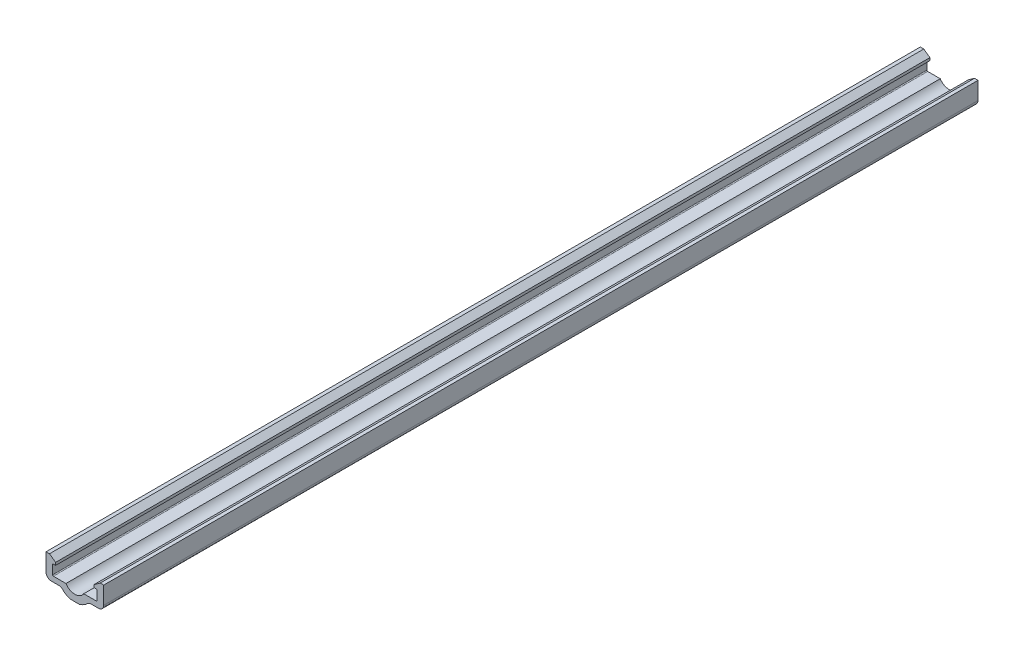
ISO-10303-21;
HEADER;
FILE_DESCRIPTION(('STEP AP214'),'2;1');
FILE_NAME('part.step','',(''),(''),'','','');
FILE_SCHEMA(('AUTOMOTIVE_DESIGN { 1 0 10303 214 1 1 1 1 }'));
ENDSEC;
DATA;
#1=APPLICATION_CONTEXT('core data for automotive mechanical design processes');
#2=APPLICATION_PROTOCOL_DEFINITION('international standard','automotive_design',2000,#1);
#3=PRODUCT_CONTEXT('',#1,'mechanical');
#4=PRODUCT('Part','Part','',(#3));
#5=PRODUCT_RELATED_PRODUCT_CATEGORY('part','',(#4));
#6=PRODUCT_DEFINITION_FORMATION('','',#4);
#7=PRODUCT_DEFINITION_CONTEXT('part definition',#1,'design');
#8=PRODUCT_DEFINITION('design','',#6,#7);
#9=PRODUCT_DEFINITION_SHAPE('','',#8);
#10=(LENGTH_UNIT() NAMED_UNIT(*) SI_UNIT(.MILLI.,.METRE.));
#11=(NAMED_UNIT(*) PLANE_ANGLE_UNIT() SI_UNIT($,.RADIAN.));
#12=(NAMED_UNIT(*) SI_UNIT($,.STERADIAN.) SOLID_ANGLE_UNIT());
#13=UNCERTAINTY_MEASURE_WITH_UNIT(LENGTH_MEASURE(1.E-05),#10,'distance_accuracy_value','');
#14=(GEOMETRIC_REPRESENTATION_CONTEXT(3) GLOBAL_UNCERTAINTY_ASSIGNED_CONTEXT((#13)) GLOBAL_UNIT_ASSIGNED_CONTEXT((#10,
#11,#12)) REPRESENTATION_CONTEXT('',''));
#15=CARTESIAN_POINT('',(0.,0.,0.));
#16=DIRECTION('',(0.,0.,1.));
#17=DIRECTION('',(1.,0.,0.));
#18=AXIS2_PLACEMENT_3D('',#15,#16,#17);
#19=CARTESIAN_POINT('',(0.,9.68245836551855,500.));
#20=DIRECTION('',(0.,0.,-1.));
#21=DIRECTION('',(-1.,0.,0.));
#22=AXIS2_PLACEMENT_3D('',#19,#20,#21);
#23=CYLINDRICAL_SURFACE('',#22,6.);
#24=CARTESIAN_POINT('',(0.,9.68245836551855,0.));
#25=DIRECTION('',(0.,0.,-1.));
#26=DIRECTION('',(1.,0.,0.));
#27=AXIS2_PLACEMENT_3D('',#24,#25,#26);
#28=CIRCLE('',#27,6.);
#29=CARTESIAN_POINT('',(5.08644854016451,6.5,0.));
#30=VERTEX_POINT('',#29);
#31=CARTESIAN_POINT('',(-5.08644854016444,6.5,0.));
#32=VERTEX_POINT('',#31);
#33=EDGE_CURVE('E202',#30,#32,#28,.T.);
#34=ORIENTED_EDGE('',*,*,#33,.T.);
#35=DIRECTION('',(0.,0.,-1.));
#36=VECTOR('',#35,1.);
#37=CARTESIAN_POINT('',(-5.08644854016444,6.5,500.));
#38=LINE('',#37,#36);
#39=CARTESIAN_POINT('',(-5.08644854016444,6.5,500.));
#40=VERTEX_POINT('',#39);
#41=EDGE_CURVE('E9',#40,#32,#38,.T.);
#42=ORIENTED_EDGE('',*,*,#41,.F.);
#43=CARTESIAN_POINT('',(0.,9.68245836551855,500.));
#44=DIRECTION('',(0.,0.,-1.));
#45=DIRECTION('',(1.,0.,0.));
#46=AXIS2_PLACEMENT_3D('',#43,#44,#45);
#47=CIRCLE('',#46,6.);
#48=CARTESIAN_POINT('',(5.08644854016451,6.5,500.));
#49=VERTEX_POINT('',#48);
#50=EDGE_CURVE('E269',#49,#40,#47,.T.);
#51=ORIENTED_EDGE('',*,*,#50,.F.);
#52=DIRECTION('',(0.,0.,-1.));
#53=VECTOR('',#52,1.);
#54=CARTESIAN_POINT('',(5.08644854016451,6.5,500.));
#55=LINE('',#54,#53);
#56=EDGE_CURVE('E215',#49,#30,#55,.T.);
#57=ORIENTED_EDGE('',*,*,#56,.T.);
#58=EDGE_LOOP('',(#34,#42,#51,#57));
#59=FACE_BOUND('',#58,.T.);
#60=ADVANCED_FACE('F14',(#59),#23,.F.);
#61=CARTESIAN_POINT('',(-5.08644854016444,6.5,500.));
#62=DIRECTION('',(0.,-1.,0.));
#63=DIRECTION('',(0.,0.,-1.));
#64=AXIS2_PLACEMENT_3D('',#61,#62,#63);
#65=PLANE('',#64);
#66=DIRECTION('',(-1.,0.,0.));
#67=VECTOR('',#66,1.);
#68=CARTESIAN_POINT('',(-5.08644854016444,6.5,0.));
#69=LINE('',#68,#67);
#70=CARTESIAN_POINT('',(-12.25,6.5,0.));
#71=VERTEX_POINT('',#70);
#72=EDGE_CURVE('E198',#32,#71,#69,.T.);
#73=ORIENTED_EDGE('',*,*,#72,.T.);
#74=DIRECTION('',(0.,0.,-1.));
#75=VECTOR('',#74,1.);
#76=CARTESIAN_POINT('',(-12.25,6.5,500.));
#77=LINE('',#76,#75);
#78=CARTESIAN_POINT('',(-12.25,6.5,500.));
#79=VERTEX_POINT('',#78);
#80=EDGE_CURVE('E21',#79,#71,#77,.T.);
#81=ORIENTED_EDGE('',*,*,#80,.F.);
#82=DIRECTION('',(-1.,0.,0.));
#83=VECTOR('',#82,1.);
#84=CARTESIAN_POINT('',(-5.08644854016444,6.5,500.));
#85=LINE('',#84,#83);
#86=EDGE_CURVE('E211',#40,#79,#85,.T.);
#87=ORIENTED_EDGE('',*,*,#86,.F.);
#88=ORIENTED_EDGE('',*,*,#41,.T.);
#89=EDGE_LOOP('',(#73,#81,#87,#88));
#90=FACE_BOUND('',#89,.T.);
#91=ADVANCED_FACE('F210',(#90),#65,.F.);
#92=CARTESIAN_POINT('',(-12.25,7.,500.));
#93=DIRECTION('',(0.,0.,-1.));
#94=DIRECTION('',(-1.,0.,0.));
#95=AXIS2_PLACEMENT_3D('',#92,#93,#94);
#96=CYLINDRICAL_SURFACE('',#95,0.5);
#97=CARTESIAN_POINT('',(-12.25,7.,0.));
#98=DIRECTION('',(0.,0.,-1.));
#99=DIRECTION('',(1.,0.,0.));
#100=AXIS2_PLACEMENT_3D('',#97,#98,#99);
#101=CIRCLE('',#100,0.5);
#102=CARTESIAN_POINT('',(-12.75,7.,0.));
#103=VERTEX_POINT('',#102);
#104=EDGE_CURVE('E204',#71,#103,#101,.T.);
#105=ORIENTED_EDGE('',*,*,#104,.T.);
#106=DIRECTION('',(0.,0.,-1.));
#107=VECTOR('',#106,1.);
#108=CARTESIAN_POINT('',(-12.75,7.,500.));
#109=LINE('',#108,#107);
#110=CARTESIAN_POINT('',(-12.75,7.,500.));
#111=VERTEX_POINT('',#110);
#112=EDGE_CURVE('E395',#111,#103,#109,.T.);
#113=ORIENTED_EDGE('',*,*,#112,.F.);
#114=CARTESIAN_POINT('',(-12.25,7.,500.));
#115=DIRECTION('',(0.,0.,-1.));
#116=DIRECTION('',(1.,0.,0.));
#117=AXIS2_PLACEMENT_3D('',#114,#115,#116);
#118=CIRCLE('',#117,0.5);
#119=EDGE_CURVE('E272',#79,#111,#118,.T.);
#120=ORIENTED_EDGE('',*,*,#119,.F.);
#121=ORIENTED_EDGE('',*,*,#80,.T.);
#122=EDGE_LOOP('',(#105,#113,#120,#121));
#123=FACE_BOUND('',#122,.T.);
#124=ADVANCED_FACE('F399',(#123),#96,.F.);
#125=CARTESIAN_POINT('',(-12.75,12.,500.));
#126=DIRECTION('',(-1.,0.,0.));
#127=DIRECTION('',(0.,0.,1.));
#128=AXIS2_PLACEMENT_3D('',#125,#126,#127);
#129=PLANE('',#128);
#130=DIRECTION('',(0.,1.,0.));
#131=VECTOR('',#130,1.);
#132=CARTESIAN_POINT('',(-12.75,12.,0.));
#133=LINE('',#132,#131);
#134=CARTESIAN_POINT('',(-12.75,12.,0.));
#135=VERTEX_POINT('',#134);
#136=EDGE_CURVE('E219',#103,#135,#133,.T.);
#137=ORIENTED_EDGE('',*,*,#136,.T.);
#138=DIRECTION('',(0.,0.,-1.));
#139=VECTOR('',#138,1.);
#140=CARTESIAN_POINT('',(-12.75,12.,500.));
#141=LINE('',#140,#139);
#142=CARTESIAN_POINT('',(-12.75,12.,500.));
#143=VERTEX_POINT('',#142);
#144=EDGE_CURVE('E392',#143,#135,#141,.T.);
#145=ORIENTED_EDGE('',*,*,#144,.F.);
#146=DIRECTION('',(0.,1.,0.));
#147=VECTOR('',#146,1.);
#148=CARTESIAN_POINT('',(-12.75,12.,500.));
#149=LINE('',#148,#147);
#150=EDGE_CURVE('E274',#111,#143,#149,.T.);
#151=ORIENTED_EDGE('',*,*,#150,.F.);
#152=ORIENTED_EDGE('',*,*,#112,.T.);
#153=EDGE_LOOP('',(#137,#145,#151,#152));
#154=FACE_BOUND('',#153,.T.);
#155=ADVANCED_FACE('F407',(#154),#129,.F.);
#156=CARTESIAN_POINT('',(-12.25,12.,500.));
#157=DIRECTION('',(0.,0.,-1.));
#158=DIRECTION('',(-1.,0.,0.));
#159=AXIS2_PLACEMENT_3D('',#156,#157,#158);
#160=CYLINDRICAL_SURFACE('',#159,0.5);
#161=CARTESIAN_POINT('',(-12.25,12.,0.));
#162=DIRECTION('',(0.,0.,-1.));
#163=DIRECTION('',(1.,0.,0.));
#164=AXIS2_PLACEMENT_3D('',#161,#162,#163);
#165=CIRCLE('',#164,0.5);
#166=CARTESIAN_POINT('',(-12.25,12.5,0.));
#167=VERTEX_POINT('',#166);
#168=EDGE_CURVE('E221',#135,#167,#165,.T.);
#169=ORIENTED_EDGE('',*,*,#168,.T.);
#170=DIRECTION('',(0.,0.,-1.));
#171=VECTOR('',#170,1.);
#172=CARTESIAN_POINT('',(-12.25,12.5,500.));
#173=LINE('',#172,#171);
#174=CARTESIAN_POINT('',(-12.25,12.5,500.));
#175=VERTEX_POINT('',#174);
#176=EDGE_CURVE('E389',#175,#167,#173,.T.);
#177=ORIENTED_EDGE('',*,*,#176,.F.);
#178=CARTESIAN_POINT('',(-12.25,12.,500.));
#179=DIRECTION('',(0.,0.,-1.));
#180=DIRECTION('',(1.,0.,0.));
#181=AXIS2_PLACEMENT_3D('',#178,#179,#180);
#182=CIRCLE('',#181,0.5);
#183=EDGE_CURVE('E276',#143,#175,#182,.T.);
#184=ORIENTED_EDGE('',*,*,#183,.F.);
#185=ORIENTED_EDGE('',*,*,#144,.T.);
#186=EDGE_LOOP('',(#169,#177,#184,#185));
#187=FACE_BOUND('',#186,.T.);
#188=ADVANCED_FACE('F410',(#187),#160,.F.);
#189=CARTESIAN_POINT('',(-11.,12.5,500.));
#190=DIRECTION('',(0.,1.,0.));
#191=DIRECTION('',(-1.,0.,0.));
#192=AXIS2_PLACEMENT_3D('',#189,#190,#191);
#193=PLANE('',#192);
#194=DIRECTION('',(1.,0.,0.));
#195=VECTOR('',#194,1.);
#196=CARTESIAN_POINT('',(-11.,12.5,0.));
#197=LINE('',#196,#195);
#198=CARTESIAN_POINT('',(-11.,12.5,0.));
#199=VERTEX_POINT('',#198);
#200=EDGE_CURVE('E223',#167,#199,#197,.T.);
#201=ORIENTED_EDGE('',*,*,#200,.T.);
#202=DIRECTION('',(0.,0.,-1.));
#203=VECTOR('',#202,1.);
#204=CARTESIAN_POINT('',(-11.,12.5,500.));
#205=LINE('',#204,#203);
#206=CARTESIAN_POINT('',(-11.,12.5,500.));
#207=VERTEX_POINT('',#206);
#208=EDGE_CURVE('E386',#207,#199,#205,.T.);
#209=ORIENTED_EDGE('',*,*,#208,.F.);
#210=DIRECTION('',(1.,0.,0.));
#211=VECTOR('',#210,1.);
#212=CARTESIAN_POINT('',(-11.,12.5,500.));
#213=LINE('',#212,#211);
#214=EDGE_CURVE('E278',#175,#207,#213,.T.);
#215=ORIENTED_EDGE('',*,*,#214,.F.);
#216=ORIENTED_EDGE('',*,*,#176,.T.);
#217=EDGE_LOOP('',(#201,#209,#215,#216));
#218=FACE_BOUND('',#217,.T.);
#219=ADVANCED_FACE('F415',(#218),#193,.F.);
#220=CARTESIAN_POINT('',(-11.,14.,500.));
#221=DIRECTION('',(-1.,0.,0.));
#222=DIRECTION('',(0.,-1.,0.));
#223=AXIS2_PLACEMENT_3D('',#220,#221,#222);
#224=PLANE('',#223);
#225=DIRECTION('',(0.,1.,0.));
#226=VECTOR('',#225,1.);
#227=CARTESIAN_POINT('',(-11.,14.,0.));
#228=LINE('',#227,#226);
#229=CARTESIAN_POINT('',(-11.,14.,0.));
#230=VERTEX_POINT('',#229);
#231=EDGE_CURVE('E225',#199,#230,#228,.T.);
#232=ORIENTED_EDGE('',*,*,#231,.T.);
#233=DIRECTION('',(0.,0.,-1.));
#234=VECTOR('',#233,1.);
#235=CARTESIAN_POINT('',(-11.,14.,500.));
#236=LINE('',#235,#234);
#237=CARTESIAN_POINT('',(-11.,14.,500.));
#238=VERTEX_POINT('',#237);
#239=EDGE_CURVE('E383',#238,#230,#236,.T.);
#240=ORIENTED_EDGE('',*,*,#239,.F.);
#241=DIRECTION('',(0.,1.,0.));
#242=VECTOR('',#241,1.);
#243=CARTESIAN_POINT('',(-11.,14.,500.));
#244=LINE('',#243,#242);
#245=EDGE_CURVE('E280',#207,#238,#244,.T.);
#246=ORIENTED_EDGE('',*,*,#245,.F.);
#247=ORIENTED_EDGE('',*,*,#208,.T.);
#248=EDGE_LOOP('',(#232,#240,#246,#247));
#249=FACE_BOUND('',#248,.T.);
#250=ADVANCED_FACE('F421',(#249),#224,.F.);
#251=CARTESIAN_POINT('',(-14.5,16.5,500.));
#252=DIRECTION('',(-0.581238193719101,-0.813733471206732,0.));
#253=DIRECTION('',(0.813733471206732,-0.581238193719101,0.));
#254=AXIS2_PLACEMENT_3D('',#251,#252,#253);
#255=PLANE('',#254);
#256=DIRECTION('',(-0.813733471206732,0.581238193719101,0.));
#257=VECTOR('',#256,1.);
#258=CARTESIAN_POINT('',(-14.5,16.5,0.));
#259=LINE('',#258,#257);
#260=CARTESIAN_POINT('',(-14.5,16.5,0.));
#261=VERTEX_POINT('',#260);
#262=EDGE_CURVE('E227',#230,#261,#259,.T.);
#263=ORIENTED_EDGE('',*,*,#262,.T.);
#264=DIRECTION('',(0.,0.,-1.));
#265=VECTOR('',#264,1.);
#266=CARTESIAN_POINT('',(-14.5,16.5,500.));
#267=LINE('',#266,#265);
#268=CARTESIAN_POINT('',(-14.5,16.5,500.));
#269=VERTEX_POINT('',#268);
#270=EDGE_CURVE('E380',#269,#261,#267,.T.);
#271=ORIENTED_EDGE('',*,*,#270,.F.);
#272=DIRECTION('',(-0.813733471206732,0.581238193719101,0.));
#273=VECTOR('',#272,1.);
#274=CARTESIAN_POINT('',(-14.5,16.5,500.));
#275=LINE('',#274,#273);
#276=EDGE_CURVE('E282',#238,#269,#275,.T.);
#277=ORIENTED_EDGE('',*,*,#276,.F.);
#278=ORIENTED_EDGE('',*,*,#239,.T.);
#279=EDGE_LOOP('',(#263,#271,#277,#278));
#280=FACE_BOUND('',#279,.T.);
#281=ADVANCED_FACE('F425',(#280),#255,.F.);
#282=CARTESIAN_POINT('',(-14.5,16.5,500.));
#283=DIRECTION('',(0.,-1.,0.));
#284=DIRECTION('',(0.,0.,-1.));
#285=AXIS2_PLACEMENT_3D('',#282,#283,#284);
#286=PLANE('',#285);
#287=DIRECTION('',(-1.,0.,0.));
#288=VECTOR('',#287,1.);
#289=CARTESIAN_POINT('',(-14.5,16.5,0.));
#290=LINE('',#289,#288);
#291=CARTESIAN_POINT('',(-16.5,16.5,0.));
#292=VERTEX_POINT('',#291);
#293=EDGE_CURVE('E229',#261,#292,#290,.T.);
#294=ORIENTED_EDGE('',*,*,#293,.T.);
#295=DIRECTION('',(0.,0.,-1.));
#296=VECTOR('',#295,1.);
#297=CARTESIAN_POINT('',(-16.5,16.5,500.));
#298=LINE('',#297,#296);
#299=CARTESIAN_POINT('',(-16.5,16.5,500.));
#300=VERTEX_POINT('',#299);
#301=EDGE_CURVE('E377',#300,#292,#298,.T.);
#302=ORIENTED_EDGE('',*,*,#301,.F.);
#303=DIRECTION('',(-1.,0.,0.));
#304=VECTOR('',#303,1.);
#305=CARTESIAN_POINT('',(-14.5,16.5,500.));
#306=LINE('',#305,#304);
#307=EDGE_CURVE('E284',#269,#300,#306,.T.);
#308=ORIENTED_EDGE('',*,*,#307,.F.);
#309=ORIENTED_EDGE('',*,*,#270,.T.);
#310=EDGE_LOOP('',(#294,#302,#308,#309));
#311=FACE_BOUND('',#310,.T.);
#312=ADVANCED_FACE('F430',(#311),#286,.F.);
#313=CARTESIAN_POINT('',(-16.5,16.5,500.));
#314=DIRECTION('',(1.,0.,0.));
#315=DIRECTION('',(0.,1.,0.));
#316=AXIS2_PLACEMENT_3D('',#313,#314,#315);
#317=PLANE('',#316);
#318=DIRECTION('',(0.,-1.,0.));
#319=VECTOR('',#318,1.);
#320=CARTESIAN_POINT('',(-16.5,16.5,0.));
#321=LINE('',#320,#319);
#322=CARTESIAN_POINT('',(-16.5,6.5,0.));
#323=VERTEX_POINT('',#322);
#324=EDGE_CURVE('E231',#292,#323,#321,.T.);
#325=ORIENTED_EDGE('',*,*,#324,.T.);
#326=DIRECTION('',(0.,0.,-1.));
#327=VECTOR('',#326,1.);
#328=CARTESIAN_POINT('',(-16.5,6.5,500.));
#329=LINE('',#328,#327);
#330=CARTESIAN_POINT('',(-16.5,6.5,500.));
#331=VERTEX_POINT('',#330);
#332=EDGE_CURVE('E374',#331,#323,#329,.T.);
#333=ORIENTED_EDGE('',*,*,#332,.F.);
#334=DIRECTION('',(0.,-1.,0.));
#335=VECTOR('',#334,1.);
#336=CARTESIAN_POINT('',(-16.5,16.5,500.));
#337=LINE('',#336,#335);
#338=EDGE_CURVE('E286',#300,#331,#337,.T.);
#339=ORIENTED_EDGE('',*,*,#338,.F.);
#340=ORIENTED_EDGE('',*,*,#301,.T.);
#341=EDGE_LOOP('',(#325,#333,#339,#340));
#342=FACE_BOUND('',#341,.T.);
#343=ADVANCED_FACE('F436',(#342),#317,.F.);
#344=CARTESIAN_POINT('',(-13.5,6.5,500.));
#345=DIRECTION('',(0.,0.,-1.));
#346=DIRECTION('',(-1.,0.,0.));
#347=AXIS2_PLACEMENT_3D('',#344,#345,#346);
#348=CYLINDRICAL_SURFACE('',#347,3.);
#349=CARTESIAN_POINT('',(-13.5,6.5,0.));
#350=DIRECTION('',(0.,0.,1.));
#351=DIRECTION('',(1.,0.,0.));
#352=AXIS2_PLACEMENT_3D('',#349,#350,#351);
#353=CIRCLE('',#352,3.);
#354=CARTESIAN_POINT('',(-13.5,3.50000000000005,0.));
#355=VERTEX_POINT('',#354);
#356=EDGE_CURVE('E233',#323,#355,#353,.T.);
#357=ORIENTED_EDGE('',*,*,#356,.T.);
#358=DIRECTION('',(0.,0.,-1.));
#359=VECTOR('',#358,1.);
#360=CARTESIAN_POINT('',(-13.5,3.50000000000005,500.));
#361=LINE('',#360,#359);
#362=CARTESIAN_POINT('',(-13.5,3.50000000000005,500.));
#363=VERTEX_POINT('',#362);
#364=EDGE_CURVE('E371',#363,#355,#361,.T.);
#365=ORIENTED_EDGE('',*,*,#364,.F.);
#366=CARTESIAN_POINT('',(-13.5,6.5,500.));
#367=DIRECTION('',(0.,0.,1.));
#368=DIRECTION('',(1.,0.,0.));
#369=AXIS2_PLACEMENT_3D('',#366,#367,#368);
#370=CIRCLE('',#369,3.);
#371=EDGE_CURVE('E288',#331,#363,#370,.T.);
#372=ORIENTED_EDGE('',*,*,#371,.F.);
#373=ORIENTED_EDGE('',*,*,#332,.T.);
#374=EDGE_LOOP('',(#357,#365,#372,#373));
#375=FACE_BOUND('',#374,.T.);
#376=ADVANCED_FACE('F440',(#375),#348,.T.);
#377=CARTESIAN_POINT('',(-9.20230723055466,3.50000000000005,500.));
#378=DIRECTION('',(0.,1.,0.));
#379=DIRECTION('',(0.,0.,1.));
#380=AXIS2_PLACEMENT_3D('',#377,#378,#379);
#381=PLANE('',#380);
#382=DIRECTION('',(1.,0.,0.));
#383=VECTOR('',#382,1.);
#384=CARTESIAN_POINT('',(-9.20230723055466,3.50000000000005,0.));
#385=LINE('',#384,#383);
#386=CARTESIAN_POINT('',(-9.20230723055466,3.50000000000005,0.));
#387=VERTEX_POINT('',#386);
#388=EDGE_CURVE('E235',#355,#387,#385,.T.);
#389=ORIENTED_EDGE('',*,*,#388,.T.);
#390=DIRECTION('',(0.,0.,-1.));
#391=VECTOR('',#390,1.);
#392=CARTESIAN_POINT('',(-9.20230723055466,3.50000000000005,500.));
#393=LINE('',#392,#391);
#394=CARTESIAN_POINT('',(-9.20230723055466,3.50000000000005,500.));
#395=VERTEX_POINT('',#394);
#396=EDGE_CURVE('E368',#395,#387,#393,.T.);
#397=ORIENTED_EDGE('',*,*,#396,.F.);
#398=DIRECTION('',(1.,0.,0.));
#399=VECTOR('',#398,1.);
#400=CARTESIAN_POINT('',(-9.20230723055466,3.50000000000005,500.));
#401=LINE('',#400,#399);
#402=EDGE_CURVE('E290',#363,#395,#401,.T.);
#403=ORIENTED_EDGE('',*,*,#402,.F.);
#404=ORIENTED_EDGE('',*,*,#364,.T.);
#405=EDGE_LOOP('',(#389,#397,#403,#404));
#406=FACE_BOUND('',#405,.T.);
#407=ADVANCED_FACE('F445',(#406),#381,.F.);
#408=CARTESIAN_POINT('',(-9.20230723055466,0.500000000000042,500.));
#409=DIRECTION('',(0.,0.,-1.));
#410=DIRECTION('',(-1.,0.,0.));
#411=AXIS2_PLACEMENT_3D('',#408,#409,#410);
#412=CYLINDRICAL_SURFACE('',#411,3.);
#413=CARTESIAN_POINT('',(-9.20230723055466,0.500000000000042,0.));
#414=DIRECTION('',(0.,0.,-1.));
#415=DIRECTION('',(1.,0.,0.));
#416=AXIS2_PLACEMENT_3D('',#413,#414,#415);
#417=CIRCLE('',#416,3.);
#418=CARTESIAN_POINT('',(-7.07869786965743,2.61902885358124,0.));
#419=VERTEX_POINT('',#418);
#420=EDGE_CURVE('E237',#387,#419,#417,.T.);
#421=ORIENTED_EDGE('',*,*,#420,.T.);
#422=DIRECTION('',(0.,0.,-1.));
#423=VECTOR('',#422,1.);
#424=CARTESIAN_POINT('',(-7.07869786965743,2.61902885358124,500.));
#425=LINE('',#424,#423);
#426=CARTESIAN_POINT('',(-7.07869786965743,2.61902885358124,500.));
#427=VERTEX_POINT('',#426);
#428=EDGE_CURVE('E365',#427,#419,#425,.T.);
#429=ORIENTED_EDGE('',*,*,#428,.F.);
#430=CARTESIAN_POINT('',(-9.20230723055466,0.500000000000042,500.));
#431=DIRECTION('',(0.,0.,-1.));
#432=DIRECTION('',(1.,0.,0.));
#433=AXIS2_PLACEMENT_3D('',#430,#431,#432);
#434=CIRCLE('',#433,3.);
#435=EDGE_CURVE('E292',#395,#427,#434,.T.);
#436=ORIENTED_EDGE('',*,*,#435,.F.);
#437=ORIENTED_EDGE('',*,*,#396,.T.);
#438=EDGE_LOOP('',(#421,#429,#436,#437));
#439=FACE_BOUND('',#438,.T.);
#440=ADVANCED_FACE('F451',(#439),#412,.F.);
#441=CARTESIAN_POINT('',(0.,9.68245836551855,500.));
#442=DIRECTION('',(0.,0.,-1.));
#443=DIRECTION('',(-1.,0.,0.));
#444=AXIS2_PLACEMENT_3D('',#441,#442,#443);
#445=CYLINDRICAL_SURFACE('',#444,10.);
#446=CARTESIAN_POINT('',(0.,9.68245836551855,0.));
#447=DIRECTION('',(0.,0.,1.));
#448=DIRECTION('',(1.,0.,0.));
#449=AXIS2_PLACEMENT_3D('',#446,#447,#448);
#450=CIRCLE('',#449,10.);
#451=CARTESIAN_POINT('',(-2.5,0.,0.));
#452=VERTEX_POINT('',#451);
#453=EDGE_CURVE('E239',#419,#452,#450,.T.);
#454=ORIENTED_EDGE('',*,*,#453,.T.);
#455=DIRECTION('',(0.,0.,-1.));
#456=VECTOR('',#455,1.);
#457=CARTESIAN_POINT('',(-2.5,0.,500.));
#458=LINE('',#457,#456);
#459=CARTESIAN_POINT('',(-2.5,0.,500.));
#460=VERTEX_POINT('',#459);
#461=EDGE_CURVE('E362',#460,#452,#458,.T.);
#462=ORIENTED_EDGE('',*,*,#461,.F.);
#463=CARTESIAN_POINT('',(0.,9.68245836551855,500.));
#464=DIRECTION('',(0.,0.,1.));
#465=DIRECTION('',(1.,0.,0.));
#466=AXIS2_PLACEMENT_3D('',#463,#464,#465);
#467=CIRCLE('',#466,10.);
#468=EDGE_CURVE('E294',#427,#460,#467,.T.);
#469=ORIENTED_EDGE('',*,*,#468,.F.);
#470=ORIENTED_EDGE('',*,*,#428,.T.);
#471=EDGE_LOOP('',(#454,#462,#469,#470));
#472=FACE_BOUND('',#471,.T.);
#473=ADVANCED_FACE('F455',(#472),#445,.T.);
#474=CARTESIAN_POINT('',(2.5,0.,500.));
#475=DIRECTION('',(0.,1.,0.));
#476=DIRECTION('',(-1.,0.,0.));
#477=AXIS2_PLACEMENT_3D('',#474,#475,#476);
#478=PLANE('',#477);
#479=DIRECTION('',(1.,0.,0.));
#480=VECTOR('',#479,1.);
#481=CARTESIAN_POINT('',(2.5,0.,0.));
#482=LINE('',#481,#480);
#483=CARTESIAN_POINT('',(2.5,0.,0.));
#484=VERTEX_POINT('',#483);
#485=EDGE_CURVE('E241',#452,#484,#482,.T.);
#486=ORIENTED_EDGE('',*,*,#485,.T.);
#487=DIRECTION('',(0.,0.,-1.));
#488=VECTOR('',#487,1.);
#489=CARTESIAN_POINT('',(2.5,0.,500.));
#490=LINE('',#489,#488);
#491=CARTESIAN_POINT('',(2.5,0.,500.));
#492=VERTEX_POINT('',#491);
#493=EDGE_CURVE('E359',#492,#484,#490,.T.);
#494=ORIENTED_EDGE('',*,*,#493,.F.);
#495=DIRECTION('',(1.,0.,0.));
#496=VECTOR('',#495,1.);
#497=CARTESIAN_POINT('',(2.5,0.,500.));
#498=LINE('',#497,#496);
#499=EDGE_CURVE('E296',#460,#492,#498,.T.);
#500=ORIENTED_EDGE('',*,*,#499,.F.);
#501=ORIENTED_EDGE('',*,*,#461,.T.);
#502=EDGE_LOOP('',(#486,#494,#500,#501));
#503=FACE_BOUND('',#502,.T.);
#504=ADVANCED_FACE('F460',(#503),#478,.F.);
#505=CARTESIAN_POINT('',(0.,9.68245836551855,500.));
#506=DIRECTION('',(0.,0.,-1.));
#507=DIRECTION('',(-1.,0.,0.));
#508=AXIS2_PLACEMENT_3D('',#505,#506,#507);
#509=CYLINDRICAL_SURFACE('',#508,10.);
#510=CARTESIAN_POINT('',(0.,9.68245836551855,0.));
#511=DIRECTION('',(0.,0.,1.));
#512=DIRECTION('',(1.,0.,0.));
#513=AXIS2_PLACEMENT_3D('',#510,#511,#512);
#514=CIRCLE('',#513,10.);
#515=CARTESIAN_POINT('',(7.0786978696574,2.61902885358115,0.));
#516=VERTEX_POINT('',#515);
#517=EDGE_CURVE('E243',#484,#516,#514,.T.);
#518=ORIENTED_EDGE('',*,*,#517,.T.);
#519=DIRECTION('',(0.,0.,-1.));
#520=VECTOR('',#519,1.);
#521=CARTESIAN_POINT('',(7.0786978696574,2.61902885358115,500.));
#522=LINE('',#521,#520);
#523=CARTESIAN_POINT('',(7.0786978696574,2.61902885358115,500.));
#524=VERTEX_POINT('',#523);
#525=EDGE_CURVE('E356',#524,#516,#522,.T.);
#526=ORIENTED_EDGE('',*,*,#525,.F.);
#527=CARTESIAN_POINT('',(0.,9.68245836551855,500.));
#528=DIRECTION('',(0.,0.,1.));
#529=DIRECTION('',(1.,0.,0.));
#530=AXIS2_PLACEMENT_3D('',#527,#528,#529);
#531=CIRCLE('',#530,10.);
#532=EDGE_CURVE('E298',#492,#524,#531,.T.);
#533=ORIENTED_EDGE('',*,*,#532,.F.);
#534=ORIENTED_EDGE('',*,*,#493,.T.);
#535=EDGE_LOOP('',(#518,#526,#533,#534));
#536=FACE_BOUND('',#535,.T.);
#537=ADVANCED_FACE('F466',(#536),#509,.T.);
#538=CARTESIAN_POINT('',(9.20230723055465,0.499999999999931,500.));
#539=DIRECTION('',(0.,0.,-1.));
#540=DIRECTION('',(-1.,0.,0.));
#541=AXIS2_PLACEMENT_3D('',#538,#539,#540);
#542=CYLINDRICAL_SURFACE('',#541,3.);
#543=CARTESIAN_POINT('',(9.20230723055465,0.499999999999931,0.));
#544=DIRECTION('',(0.,0.,-1.));
#545=DIRECTION('',(1.,0.,0.));
#546=AXIS2_PLACEMENT_3D('',#543,#544,#545);
#547=CIRCLE('',#546,3.);
#548=CARTESIAN_POINT('',(9.20230723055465,3.49999999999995,0.));
#549=VERTEX_POINT('',#548);
#550=EDGE_CURVE('E245',#516,#549,#547,.T.);
#551=ORIENTED_EDGE('',*,*,#550,.T.);
#552=DIRECTION('',(0.,0.,-1.));
#553=VECTOR('',#552,1.);
#554=CARTESIAN_POINT('',(9.20230723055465,3.49999999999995,500.));
#555=LINE('',#554,#553);
#556=CARTESIAN_POINT('',(9.20230723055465,3.49999999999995,500.));
#557=VERTEX_POINT('',#556);
#558=EDGE_CURVE('E353',#557,#549,#555,.T.);
#559=ORIENTED_EDGE('',*,*,#558,.F.);
#560=CARTESIAN_POINT('',(9.20230723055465,0.499999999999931,500.));
#561=DIRECTION('',(0.,0.,-1.));
#562=DIRECTION('',(1.,0.,0.));
#563=AXIS2_PLACEMENT_3D('',#560,#561,#562);
#564=CIRCLE('',#563,3.);
#565=EDGE_CURVE('E300',#524,#557,#564,.T.);
#566=ORIENTED_EDGE('',*,*,#565,.F.);
#567=ORIENTED_EDGE('',*,*,#525,.T.);
#568=EDGE_LOOP('',(#551,#559,#566,#567));
#569=FACE_BOUND('',#568,.T.);
#570=ADVANCED_FACE('F470',(#569),#542,.F.);
#571=CARTESIAN_POINT('',(13.5,3.49999999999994,500.));
#572=DIRECTION('',(0.,1.,0.));
#573=DIRECTION('',(0.,0.,1.));
#574=AXIS2_PLACEMENT_3D('',#571,#572,#573);
#575=PLANE('',#574);
#576=DIRECTION('',(1.,0.,0.));
#577=VECTOR('',#576,1.);
#578=CARTESIAN_POINT('',(13.5,3.49999999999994,0.));
#579=LINE('',#578,#577);
#580=CARTESIAN_POINT('',(13.5,3.49999999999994,0.));
#581=VERTEX_POINT('',#580);
#582=EDGE_CURVE('E247',#549,#581,#579,.T.);
#583=ORIENTED_EDGE('',*,*,#582,.T.);
#584=DIRECTION('',(0.,0.,-1.));
#585=VECTOR('',#584,1.);
#586=CARTESIAN_POINT('',(13.5,3.49999999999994,500.));
#587=LINE('',#586,#585);
#588=CARTESIAN_POINT('',(13.5,3.49999999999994,500.));
#589=VERTEX_POINT('',#588);
#590=EDGE_CURVE('E350',#589,#581,#587,.T.);
#591=ORIENTED_EDGE('',*,*,#590,.F.);
#592=DIRECTION('',(1.,0.,0.));
#593=VECTOR('',#592,1.);
#594=CARTESIAN_POINT('',(13.5,3.49999999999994,500.));
#595=LINE('',#594,#593);
#596=EDGE_CURVE('E302',#557,#589,#595,.T.);
#597=ORIENTED_EDGE('',*,*,#596,.F.);
#598=ORIENTED_EDGE('',*,*,#558,.T.);
#599=EDGE_LOOP('',(#583,#591,#597,#598));
#600=FACE_BOUND('',#599,.T.);
#601=ADVANCED_FACE('F475',(#600),#575,.F.);
#602=CARTESIAN_POINT('',(13.5,6.5,500.));
#603=DIRECTION('',(0.,0.,-1.));
#604=DIRECTION('',(-1.,0.,0.));
#605=AXIS2_PLACEMENT_3D('',#602,#603,#604);
#606=CYLINDRICAL_SURFACE('',#605,3.);
#607=CARTESIAN_POINT('',(13.5,6.5,0.));
#608=DIRECTION('',(0.,0.,1.));
#609=DIRECTION('',(1.,0.,0.));
#610=AXIS2_PLACEMENT_3D('',#607,#608,#609);
#611=CIRCLE('',#610,3.);
#612=CARTESIAN_POINT('',(16.5,6.49999999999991,0.));
#613=VERTEX_POINT('',#612);
#614=EDGE_CURVE('E249',#581,#613,#611,.T.);
#615=ORIENTED_EDGE('',*,*,#614,.T.);
#616=DIRECTION('',(0.,0.,-1.));
#617=VECTOR('',#616,1.);
#618=CARTESIAN_POINT('',(16.5,6.49999999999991,500.));
#619=LINE('',#618,#617);
#620=CARTESIAN_POINT('',(16.5,6.49999999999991,500.));
#621=VERTEX_POINT('',#620);
#622=EDGE_CURVE('E347',#621,#613,#619,.T.);
#623=ORIENTED_EDGE('',*,*,#622,.F.);
#624=CARTESIAN_POINT('',(13.5,6.5,500.));
#625=DIRECTION('',(0.,0.,1.));
#626=DIRECTION('',(1.,0.,0.));
#627=AXIS2_PLACEMENT_3D('',#624,#625,#626);
#628=CIRCLE('',#627,3.);
#629=EDGE_CURVE('E304',#589,#621,#628,.T.);
#630=ORIENTED_EDGE('',*,*,#629,.F.);
#631=ORIENTED_EDGE('',*,*,#590,.T.);
#632=EDGE_LOOP('',(#615,#623,#630,#631));
#633=FACE_BOUND('',#632,.T.);
#634=ADVANCED_FACE('F481',(#633),#606,.T.);
#635=CARTESIAN_POINT('',(16.5,16.5,500.));
#636=DIRECTION('',(-1.,0.,0.));
#637=DIRECTION('',(0.,0.,1.));
#638=AXIS2_PLACEMENT_3D('',#635,#636,#637);
#639=PLANE('',#638);
#640=DIRECTION('',(0.,1.,0.));
#641=VECTOR('',#640,1.);
#642=CARTESIAN_POINT('',(16.5,16.5,0.));
#643=LINE('',#642,#641);
#644=CARTESIAN_POINT('',(16.5,16.5,0.));
#645=VERTEX_POINT('',#644);
#646=EDGE_CURVE('E251',#613,#645,#643,.T.);
#647=ORIENTED_EDGE('',*,*,#646,.T.);
#648=DIRECTION('',(0.,0.,-1.));
#649=VECTOR('',#648,1.);
#650=CARTESIAN_POINT('',(16.5,16.5,500.));
#651=LINE('',#650,#649);
#652=CARTESIAN_POINT('',(16.5,16.5,500.));
#653=VERTEX_POINT('',#652);
#654=EDGE_CURVE('E344',#653,#645,#651,.T.);
#655=ORIENTED_EDGE('',*,*,#654,.F.);
#656=DIRECTION('',(0.,1.,0.));
#657=VECTOR('',#656,1.);
#658=CARTESIAN_POINT('',(16.5,16.5,500.));
#659=LINE('',#658,#657);
#660=EDGE_CURVE('E306',#621,#653,#659,.T.);
#661=ORIENTED_EDGE('',*,*,#660,.F.);
#662=ORIENTED_EDGE('',*,*,#622,.T.);
#663=EDGE_LOOP('',(#647,#655,#661,#662));
#664=FACE_BOUND('',#663,.T.);
#665=ADVANCED_FACE('F485',(#664),#639,.F.);
#666=CARTESIAN_POINT('',(16.5,16.5,500.));
#667=DIRECTION('',(0.,-1.,0.));
#668=DIRECTION('',(0.,0.,-1.));
#669=AXIS2_PLACEMENT_3D('',#666,#667,#668);
#670=PLANE('',#669);
#671=DIRECTION('',(-1.,0.,0.));
#672=VECTOR('',#671,1.);
#673=CARTESIAN_POINT('',(16.5,16.5,0.));
#674=LINE('',#673,#672);
#675=CARTESIAN_POINT('',(14.5,16.5,0.));
#676=VERTEX_POINT('',#675);
#677=EDGE_CURVE('E253',#645,#676,#674,.T.);
#678=ORIENTED_EDGE('',*,*,#677,.T.);
#679=DIRECTION('',(0.,0.,-1.));
#680=VECTOR('',#679,1.);
#681=CARTESIAN_POINT('',(14.5,16.5,500.));
#682=LINE('',#681,#680);
#683=CARTESIAN_POINT('',(14.5,16.5,500.));
#684=VERTEX_POINT('',#683);
#685=EDGE_CURVE('E341',#684,#676,#682,.T.);
#686=ORIENTED_EDGE('',*,*,#685,.F.);
#687=DIRECTION('',(-1.,0.,0.));
#688=VECTOR('',#687,1.);
#689=CARTESIAN_POINT('',(16.5,16.5,500.));
#690=LINE('',#689,#688);
#691=EDGE_CURVE('E308',#653,#684,#690,.T.);
#692=ORIENTED_EDGE('',*,*,#691,.F.);
#693=ORIENTED_EDGE('',*,*,#654,.T.);
#694=EDGE_LOOP('',(#678,#686,#692,#693));
#695=FACE_BOUND('',#694,.T.);
#696=ADVANCED_FACE('F490',(#695),#670,.F.);
#697=CARTESIAN_POINT('',(14.5,16.5,500.));
#698=DIRECTION('',(0.581238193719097,-0.813733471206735,0.));
#699=DIRECTION('',(0.813733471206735,0.581238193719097,0.));
#700=AXIS2_PLACEMENT_3D('',#697,#698,#699);
#701=PLANE('',#700);
#702=DIRECTION('',(-0.813733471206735,-0.581238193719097,0.));
#703=VECTOR('',#702,1.);
#704=CARTESIAN_POINT('',(14.5,16.5,0.));
#705=LINE('',#704,#703);
#706=CARTESIAN_POINT('',(11.,14.,0.));
#707=VERTEX_POINT('',#706);
#708=EDGE_CURVE('E255',#676,#707,#705,.T.);
#709=ORIENTED_EDGE('',*,*,#708,.T.);
#710=DIRECTION('',(0.,0.,-1.));
#711=VECTOR('',#710,1.);
#712=CARTESIAN_POINT('',(11.,14.,500.));
#713=LINE('',#712,#711);
#714=CARTESIAN_POINT('',(11.,14.,500.));
#715=VERTEX_POINT('',#714);
#716=EDGE_CURVE('E338',#715,#707,#713,.T.);
#717=ORIENTED_EDGE('',*,*,#716,.F.);
#718=DIRECTION('',(-0.813733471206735,-0.581238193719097,0.));
#719=VECTOR('',#718,1.);
#720=CARTESIAN_POINT('',(14.5,16.5,500.));
#721=LINE('',#720,#719);
#722=EDGE_CURVE('E310',#684,#715,#721,.T.);
#723=ORIENTED_EDGE('',*,*,#722,.F.);
#724=ORIENTED_EDGE('',*,*,#685,.T.);
#725=EDGE_LOOP('',(#709,#717,#723,#724));
#726=FACE_BOUND('',#725,.T.);
#727=ADVANCED_FACE('F496',(#726),#701,.F.);
#728=CARTESIAN_POINT('',(11.,14.,500.));
#729=DIRECTION('',(1.,0.,0.));
#730=DIRECTION('',(0.,1.,0.));
#731=AXIS2_PLACEMENT_3D('',#728,#729,#730);
#732=PLANE('',#731);
#733=DIRECTION('',(0.,-1.,0.));
#734=VECTOR('',#733,1.);
#735=CARTESIAN_POINT('',(11.,14.,0.));
#736=LINE('',#735,#734);
#737=CARTESIAN_POINT('',(11.,12.5,0.));
#738=VERTEX_POINT('',#737);
#739=EDGE_CURVE('E257',#707,#738,#736,.T.);
#740=ORIENTED_EDGE('',*,*,#739,.T.);
#741=DIRECTION('',(0.,0.,-1.));
#742=VECTOR('',#741,1.);
#743=CARTESIAN_POINT('',(11.,12.5,500.));
#744=LINE('',#743,#742);
#745=CARTESIAN_POINT('',(11.,12.5,500.));
#746=VERTEX_POINT('',#745);
#747=EDGE_CURVE('E335',#746,#738,#744,.T.);
#748=ORIENTED_EDGE('',*,*,#747,.F.);
#749=DIRECTION('',(0.,-1.,0.));
#750=VECTOR('',#749,1.);
#751=CARTESIAN_POINT('',(11.,14.,500.));
#752=LINE('',#751,#750);
#753=EDGE_CURVE('E312',#715,#746,#752,.T.);
#754=ORIENTED_EDGE('',*,*,#753,.F.);
#755=ORIENTED_EDGE('',*,*,#716,.T.);
#756=EDGE_LOOP('',(#740,#748,#754,#755));
#757=FACE_BOUND('',#756,.T.);
#758=ADVANCED_FACE('F500',(#757),#732,.F.);
#759=CARTESIAN_POINT('',(12.25,12.5,500.));
#760=DIRECTION('',(0.,1.,0.));
#761=DIRECTION('',(0.,0.,1.));
#762=AXIS2_PLACEMENT_3D('',#759,#760,#761);
#763=PLANE('',#762);
#764=DIRECTION('',(1.,0.,0.));
#765=VECTOR('',#764,1.);
#766=CARTESIAN_POINT('',(12.25,12.5,0.));
#767=LINE('',#766,#765);
#768=CARTESIAN_POINT('',(12.25,12.5,0.));
#769=VERTEX_POINT('',#768);
#770=EDGE_CURVE('E259',#738,#769,#767,.T.);
#771=ORIENTED_EDGE('',*,*,#770,.T.);
#772=DIRECTION('',(0.,0.,-1.));
#773=VECTOR('',#772,1.);
#774=CARTESIAN_POINT('',(12.25,12.5,500.));
#775=LINE('',#774,#773);
#776=CARTESIAN_POINT('',(12.25,12.5,500.));
#777=VERTEX_POINT('',#776);
#778=EDGE_CURVE('E332',#777,#769,#775,.T.);
#779=ORIENTED_EDGE('',*,*,#778,.F.);
#780=DIRECTION('',(1.,0.,0.));
#781=VECTOR('',#780,1.);
#782=CARTESIAN_POINT('',(12.25,12.5,500.));
#783=LINE('',#782,#781);
#784=EDGE_CURVE('E314',#746,#777,#783,.T.);
#785=ORIENTED_EDGE('',*,*,#784,.F.);
#786=ORIENTED_EDGE('',*,*,#747,.T.);
#787=EDGE_LOOP('',(#771,#779,#785,#786));
#788=FACE_BOUND('',#787,.T.);
#789=ADVANCED_FACE('F505',(#788),#763,.F.);
#790=CARTESIAN_POINT('',(12.25,12.,500.));
#791=DIRECTION('',(0.,0.,-1.));
#792=DIRECTION('',(-1.,0.,0.));
#793=AXIS2_PLACEMENT_3D('',#790,#791,#792);
#794=CYLINDRICAL_SURFACE('',#793,0.5);
#795=CARTESIAN_POINT('',(12.25,12.,0.));
#796=DIRECTION('',(0.,0.,-1.));
#797=DIRECTION('',(1.,0.,0.));
#798=AXIS2_PLACEMENT_3D('',#795,#796,#797);
#799=CIRCLE('',#798,0.5);
#800=CARTESIAN_POINT('',(12.75,12.,0.));
#801=VERTEX_POINT('',#800);
#802=EDGE_CURVE('E261',#769,#801,#799,.T.);
#803=ORIENTED_EDGE('',*,*,#802,.T.);
#804=DIRECTION('',(0.,0.,-1.));
#805=VECTOR('',#804,1.);
#806=CARTESIAN_POINT('',(12.75,12.,500.));
#807=LINE('',#806,#805);
#808=CARTESIAN_POINT('',(12.75,12.,500.));
#809=VERTEX_POINT('',#808);
#810=EDGE_CURVE('E329',#809,#801,#807,.T.);
#811=ORIENTED_EDGE('',*,*,#810,.F.);
#812=CARTESIAN_POINT('',(12.25,12.,500.));
#813=DIRECTION('',(0.,0.,-1.));
#814=DIRECTION('',(1.,0.,0.));
#815=AXIS2_PLACEMENT_3D('',#812,#813,#814);
#816=CIRCLE('',#815,0.5);
#817=EDGE_CURVE('E316',#777,#809,#816,.T.);
#818=ORIENTED_EDGE('',*,*,#817,.F.);
#819=ORIENTED_EDGE('',*,*,#778,.T.);
#820=EDGE_LOOP('',(#803,#811,#818,#819));
#821=FACE_BOUND('',#820,.T.);
#822=ADVANCED_FACE('F511',(#821),#794,.F.);
#823=CARTESIAN_POINT('',(12.75,12.,500.));
#824=DIRECTION('',(1.,0.,0.));
#825=DIRECTION('',(0.,0.,-1.));
#826=AXIS2_PLACEMENT_3D('',#823,#824,#825);
#827=PLANE('',#826);
#828=DIRECTION('',(0.,-1.,0.));
#829=VECTOR('',#828,1.);
#830=CARTESIAN_POINT('',(12.75,12.,0.));
#831=LINE('',#830,#829);
#832=CARTESIAN_POINT('',(12.75,7.,0.));
#833=VERTEX_POINT('',#832);
#834=EDGE_CURVE('E263',#801,#833,#831,.T.);
#835=ORIENTED_EDGE('',*,*,#834,.T.);
#836=DIRECTION('',(0.,0.,-1.));
#837=VECTOR('',#836,1.);
#838=CARTESIAN_POINT('',(12.75,7.,500.));
#839=LINE('',#838,#837);
#840=CARTESIAN_POINT('',(12.75,7.,500.));
#841=VERTEX_POINT('',#840);
#842=EDGE_CURVE('E326',#841,#833,#839,.T.);
#843=ORIENTED_EDGE('',*,*,#842,.F.);
#844=DIRECTION('',(0.,-1.,0.));
#845=VECTOR('',#844,1.);
#846=CARTESIAN_POINT('',(12.75,12.,500.));
#847=LINE('',#846,#845);
#848=EDGE_CURVE('E318',#809,#841,#847,.T.);
#849=ORIENTED_EDGE('',*,*,#848,.F.);
#850=ORIENTED_EDGE('',*,*,#810,.T.);
#851=EDGE_LOOP('',(#835,#843,#849,#850));
#852=FACE_BOUND('',#851,.T.);
#853=ADVANCED_FACE('F515',(#852),#827,.F.);
#854=CARTESIAN_POINT('',(12.25,7.,500.));
#855=DIRECTION('',(0.,0.,-1.));
#856=DIRECTION('',(-1.,0.,0.));
#857=AXIS2_PLACEMENT_3D('',#854,#855,#856);
#858=CYLINDRICAL_SURFACE('',#857,0.5);
#859=CARTESIAN_POINT('',(12.25,7.,0.));
#860=DIRECTION('',(0.,0.,-1.));
#861=DIRECTION('',(1.,0.,0.));
#862=AXIS2_PLACEMENT_3D('',#859,#860,#861);
#863=CIRCLE('',#862,0.5);
#864=CARTESIAN_POINT('',(12.25,6.5,0.));
#865=VERTEX_POINT('',#864);
#866=EDGE_CURVE('E265',#833,#865,#863,.T.);
#867=ORIENTED_EDGE('',*,*,#866,.T.);
#868=DIRECTION('',(0.,0.,-1.));
#869=VECTOR('',#868,1.);
#870=CARTESIAN_POINT('',(12.25,6.5,500.));
#871=LINE('',#870,#869);
#872=CARTESIAN_POINT('',(12.25,6.5,500.));
#873=VERTEX_POINT('',#872);
#874=EDGE_CURVE('E323',#873,#865,#871,.T.);
#875=ORIENTED_EDGE('',*,*,#874,.F.);
#876=CARTESIAN_POINT('',(12.25,7.,500.));
#877=DIRECTION('',(0.,0.,-1.));
#878=DIRECTION('',(1.,0.,0.));
#879=AXIS2_PLACEMENT_3D('',#876,#877,#878);
#880=CIRCLE('',#879,0.5);
#881=EDGE_CURVE('E33',#841,#873,#880,.T.);
#882=ORIENTED_EDGE('',*,*,#881,.F.);
#883=ORIENTED_EDGE('',*,*,#842,.T.);
#884=EDGE_LOOP('',(#867,#875,#882,#883));
#885=FACE_BOUND('',#884,.T.);
#886=ADVANCED_FACE('F518',(#885),#858,.F.);
#887=CARTESIAN_POINT('',(12.25,6.5,500.));
#888=DIRECTION('',(0.,-1.,0.));
#889=DIRECTION('',(1.,0.,0.));
#890=AXIS2_PLACEMENT_3D('',#887,#888,#889);
#891=PLANE('',#890);
#892=DIRECTION('',(-1.,0.,0.));
#893=VECTOR('',#892,1.);
#894=CARTESIAN_POINT('',(12.25,6.5,0.));
#895=LINE('',#894,#893);
#896=EDGE_CURVE('E267',#865,#30,#895,.T.);
#897=ORIENTED_EDGE('',*,*,#896,.T.);
#898=ORIENTED_EDGE('',*,*,#56,.F.);
#899=DIRECTION('',(-1.,0.,0.));
#900=VECTOR('',#899,1.);
#901=CARTESIAN_POINT('',(12.25,6.5,500.));
#902=LINE('',#901,#900);
#903=EDGE_CURVE('E28',#873,#49,#902,.T.);
#904=ORIENTED_EDGE('',*,*,#903,.F.);
#905=ORIENTED_EDGE('',*,*,#874,.T.);
#906=EDGE_LOOP('',(#897,#898,#904,#905));
#907=FACE_BOUND('',#906,.T.);
#908=ADVANCED_FACE('F520',(#907),#891,.F.);
#909=CARTESIAN_POINT('',(0.,9.68245836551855,500.));
#910=DIRECTION('',(0.,0.,1.));
#911=DIRECTION('',(1.,0.,0.));
#912=AXIS2_PLACEMENT_3D('',#909,#910,#911);
#913=PLANE('',#912);
#914=ORIENTED_EDGE('',*,*,#50,.T.);
#915=ORIENTED_EDGE('',*,*,#86,.T.);
#916=ORIENTED_EDGE('',*,*,#119,.T.);
#917=ORIENTED_EDGE('',*,*,#150,.T.);
#918=ORIENTED_EDGE('',*,*,#183,.T.);
#919=ORIENTED_EDGE('',*,*,#214,.T.);
#920=ORIENTED_EDGE('',*,*,#245,.T.);
#921=ORIENTED_EDGE('',*,*,#276,.T.);
#922=ORIENTED_EDGE('',*,*,#307,.T.);
#923=ORIENTED_EDGE('',*,*,#338,.T.);
#924=ORIENTED_EDGE('',*,*,#371,.T.);
#925=ORIENTED_EDGE('',*,*,#402,.T.);
#926=ORIENTED_EDGE('',*,*,#435,.T.);
#927=ORIENTED_EDGE('',*,*,#468,.T.);
#928=ORIENTED_EDGE('',*,*,#499,.T.);
#929=ORIENTED_EDGE('',*,*,#532,.T.);
#930=ORIENTED_EDGE('',*,*,#565,.T.);
#931=ORIENTED_EDGE('',*,*,#596,.T.);
#932=ORIENTED_EDGE('',*,*,#629,.T.);
#933=ORIENTED_EDGE('',*,*,#660,.T.);
#934=ORIENTED_EDGE('',*,*,#691,.T.);
#935=ORIENTED_EDGE('',*,*,#722,.T.);
#936=ORIENTED_EDGE('',*,*,#753,.T.);
#937=ORIENTED_EDGE('',*,*,#784,.T.);
#938=ORIENTED_EDGE('',*,*,#817,.T.);
#939=ORIENTED_EDGE('',*,*,#848,.T.);
#940=ORIENTED_EDGE('',*,*,#881,.T.);
#941=ORIENTED_EDGE('',*,*,#903,.T.);
#942=EDGE_LOOP('',(#914,#915,#916,#917,#918,#919,#920,#921,#922,#923,#924,#925,#926,#927,#928,
#929,#930,#931,#932,#933,#934,#935,#936,#937,#938,#939,#940,#941));
#943=FACE_BOUND('',#942,.T.);
#944=ADVANCED_FACE('F402',(#943),#913,.T.);
#945=CARTESIAN_POINT('',(0.,9.68245836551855,0.));
#946=DIRECTION('',(0.,0.,1.));
#947=DIRECTION('',(1.,0.,0.));
#948=AXIS2_PLACEMENT_3D('',#945,#946,#947);
#949=PLANE('',#948);
#950=ORIENTED_EDGE('',*,*,#33,.F.);
#951=ORIENTED_EDGE('',*,*,#896,.F.);
#952=ORIENTED_EDGE('',*,*,#866,.F.);
#953=ORIENTED_EDGE('',*,*,#834,.F.);
#954=ORIENTED_EDGE('',*,*,#802,.F.);
#955=ORIENTED_EDGE('',*,*,#770,.F.);
#956=ORIENTED_EDGE('',*,*,#739,.F.);
#957=ORIENTED_EDGE('',*,*,#708,.F.);
#958=ORIENTED_EDGE('',*,*,#677,.F.);
#959=ORIENTED_EDGE('',*,*,#646,.F.);
#960=ORIENTED_EDGE('',*,*,#614,.F.);
#961=ORIENTED_EDGE('',*,*,#582,.F.);
#962=ORIENTED_EDGE('',*,*,#550,.F.);
#963=ORIENTED_EDGE('',*,*,#517,.F.);
#964=ORIENTED_EDGE('',*,*,#485,.F.);
#965=ORIENTED_EDGE('',*,*,#453,.F.);
#966=ORIENTED_EDGE('',*,*,#420,.F.);
#967=ORIENTED_EDGE('',*,*,#388,.F.);
#968=ORIENTED_EDGE('',*,*,#356,.F.);
#969=ORIENTED_EDGE('',*,*,#324,.F.);
#970=ORIENTED_EDGE('',*,*,#293,.F.);
#971=ORIENTED_EDGE('',*,*,#262,.F.);
#972=ORIENTED_EDGE('',*,*,#231,.F.);
#973=ORIENTED_EDGE('',*,*,#200,.F.);
#974=ORIENTED_EDGE('',*,*,#168,.F.);
#975=ORIENTED_EDGE('',*,*,#136,.F.);
#976=ORIENTED_EDGE('',*,*,#104,.F.);
#977=ORIENTED_EDGE('',*,*,#72,.F.);
#978=EDGE_LOOP('',(#950,#951,#952,#953,#954,#955,#956,#957,#958,#959,#960,#961,#962,#963,#964,
#965,#966,#967,#968,#969,#970,#971,#972,#973,#974,#975,#976,#977));
#979=FACE_BOUND('',#978,.T.);
#980=ADVANCED_FACE('F199',(#979),#949,.F.);
#981=CLOSED_SHELL('',(#60,#91,#124,#155,#188,#219,#250,#281,#312,#343,#376,#407,#440,#473,#504,
#537,#570,#601,#634,#665,#696,#727,#758,#789,#822,#853,#886,#908,#944,#980));
#982=MANIFOLD_SOLID_BREP('B1',#981);
#983=ADVANCED_BREP_SHAPE_REPRESENTATION('',(#18,#982),#14);
#984=SHAPE_DEFINITION_REPRESENTATION(#9,#983);
ENDSEC;
END-ISO-10303-21;
